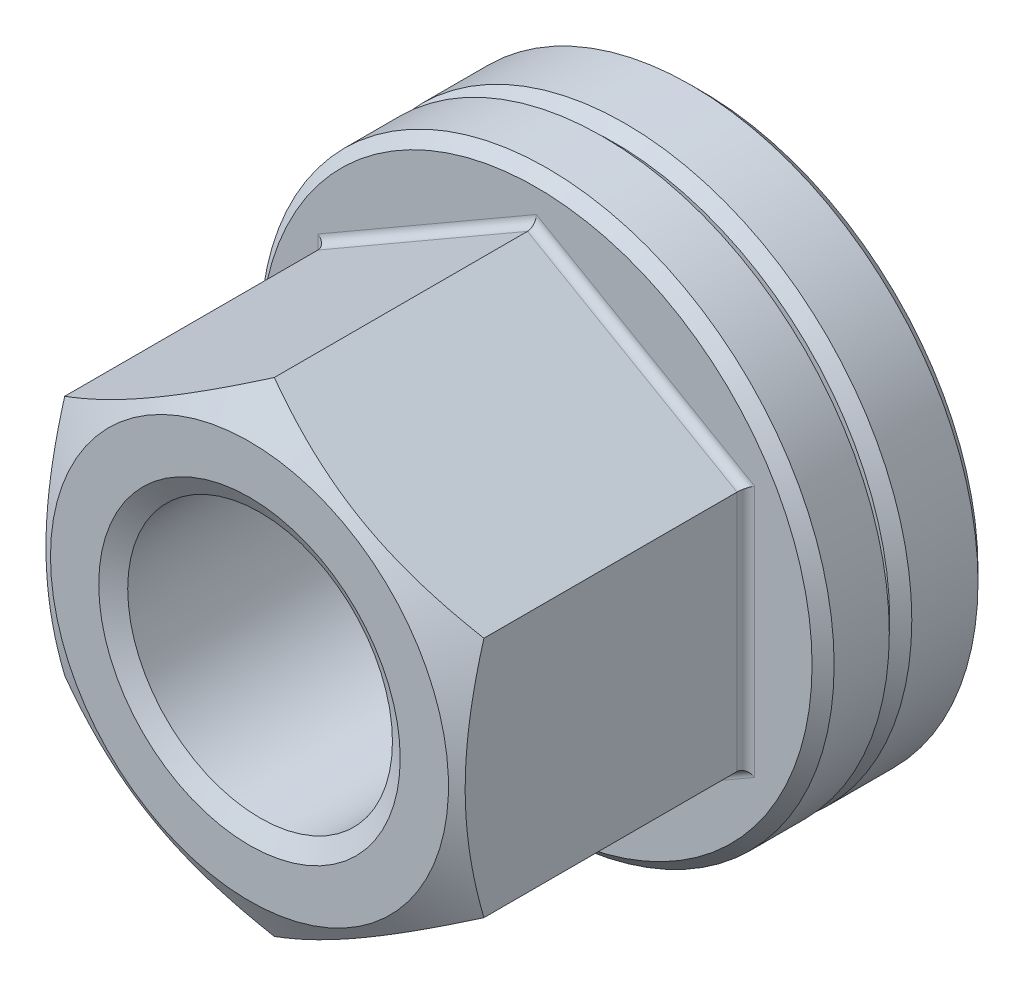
ISO-10303-21;
HEADER;
FILE_DESCRIPTION(('STEP AP214'),'2;1');
FILE_NAME('part.step','',(''),(''),'','','');
FILE_SCHEMA(('AUTOMOTIVE_DESIGN { 1 0 10303 214 1 1 1 1 }'));
ENDSEC;
DATA;
#1=APPLICATION_CONTEXT('core data for automotive mechanical design processes');
#2=APPLICATION_PROTOCOL_DEFINITION('international standard','automotive_design',2000,#1);
#3=PRODUCT_CONTEXT('',#1,'mechanical');
#4=PRODUCT('Part','Part','',(#3));
#5=PRODUCT_RELATED_PRODUCT_CATEGORY('part','',(#4));
#6=PRODUCT_DEFINITION_FORMATION('','',#4);
#7=PRODUCT_DEFINITION_CONTEXT('part definition',#1,'design');
#8=PRODUCT_DEFINITION('design','',#6,#7);
#9=PRODUCT_DEFINITION_SHAPE('','',#8);
#10=(LENGTH_UNIT() NAMED_UNIT(*) SI_UNIT(.MILLI.,.METRE.));
#11=(NAMED_UNIT(*) PLANE_ANGLE_UNIT() SI_UNIT($,.RADIAN.));
#12=(NAMED_UNIT(*) SI_UNIT($,.STERADIAN.) SOLID_ANGLE_UNIT());
#13=UNCERTAINTY_MEASURE_WITH_UNIT(LENGTH_MEASURE(1.E-05),#10,'distance_accuracy_value','');
#14=(GEOMETRIC_REPRESENTATION_CONTEXT(3) GLOBAL_UNCERTAINTY_ASSIGNED_CONTEXT((#13)) GLOBAL_UNIT_ASSIGNED_CONTEXT((#10,
#11,#12)) REPRESENTATION_CONTEXT('',''));
#15=CARTESIAN_POINT('',(0.,0.,0.));
#16=DIRECTION('',(0.,0.,1.));
#17=DIRECTION('',(1.,0.,0.));
#18=AXIS2_PLACEMENT_3D('',#15,#16,#17);
#19=CARTESIAN_POINT('',(0.,0.,4.));
#20=DIRECTION('',(0.,0.,1.));
#21=DIRECTION('',(1.,0.,0.));
#22=AXIS2_PLACEMENT_3D('',#19,#20,#21);
#23=PLANE('',#22);
#24=CARTESIAN_POINT('',(0.,0.,4.));
#25=DIRECTION('',(0.,0.,1.));
#26=DIRECTION('',(1.,0.,0.));
#27=AXIS2_PLACEMENT_3D('',#24,#25,#26);
#28=CIRCLE('',#27,12.5);
#29=CARTESIAN_POINT('',(12.5,0.,4.));
#30=VERTEX_POINT('',#29);
#31=EDGE_CURVE('E381',#30,#30,#28,.T.);
#32=ORIENTED_EDGE('',*,*,#31,.T.);
#33=EDGE_LOOP('',(#32));
#34=FACE_BOUND('',#33,.T.);
#35=CARTESIAN_POINT('',(0.,0.,4.));
#36=DIRECTION('',(0.,0.,1.));
#37=DIRECTION('',(1.,0.,0.));
#38=AXIS2_PLACEMENT_3D('',#35,#36,#37);
#39=CIRCLE('',#38,11.8563781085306);
#40=CARTESIAN_POINT('',(0.,11.8563781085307,4.));
#41=VERTEX_POINT('',#40);
#42=EDGE_CURVE('E9',#41,#41,#39,.F.);
#43=ORIENTED_EDGE('',*,*,#42,.T.);
#44=EDGE_LOOP('',(#43));
#45=FACE_BOUND('',#44,.T.);
#46=ADVANCED_FACE('F14',(#34,#45),#23,.T.);
#47=CARTESIAN_POINT('',(0.,0.,39.3553390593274));
#48=DIRECTION('',(0.,0.,-1.));
#49=DIRECTION('',(-1.,0.,0.));
#50=AXIS2_PLACEMENT_3D('',#47,#48,#49);
#51=CYLINDRICAL_SURFACE('',#50,8.);
#52=CARTESIAN_POINT('',(0.,0.,2.54411906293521));
#53=DIRECTION('',(0.,0.,1.));
#54=DIRECTION('',(1.,0.,0.));
#55=AXIS2_PLACEMENT_3D('',#52,#53,#54);
#56=CIRCLE('',#55,8.);
#57=CARTESIAN_POINT('',(8.,0.,2.54411906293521));
#58=VERTEX_POINT('',#57);
#59=EDGE_CURVE('E153',#58,#58,#56,.T.);
#60=ORIENTED_EDGE('',*,*,#59,.F.);
#61=EDGE_LOOP('',(#60));
#62=FACE_BOUND('',#61,.T.);
#63=CARTESIAN_POINT('',(0.,0.,2.64402577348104));
#64=DIRECTION('',(0.,0.,1.));
#65=DIRECTION('',(1.,0.,0.));
#66=AXIS2_PLACEMENT_3D('',#63,#64,#65);
#67=CIRCLE('',#66,8.);
#68=CARTESIAN_POINT('',(0.,8.00000000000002,2.64402577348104));
#69=VERTEX_POINT('',#68);
#70=EDGE_CURVE('E22',#69,#69,#67,.F.);
#71=ORIENTED_EDGE('',*,*,#70,.F.);
#72=EDGE_LOOP('',(#71));
#73=FACE_BOUND('',#72,.T.);
#74=ADVANCED_FACE('F333',(#62,#73),#51,.F.);
#75=CARTESIAN_POINT('',(0.,0.,2.36213394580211));
#76=DIRECTION('',(0.,0.,1.));
#77=DIRECTION('',(1.,0.,0.));
#78=AXIS2_PLACEMENT_3D('',#75,#76,#77);
#79=CONICAL_SURFACE('',#78,7.5,1.22173047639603);
#80=CARTESIAN_POINT('',(0.,0.,2.36213394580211));
#81=DIRECTION('',(0.,0.,1.));
#82=DIRECTION('',(1.,0.,0.));
#83=AXIS2_PLACEMENT_3D('',#80,#81,#82);
#84=CIRCLE('',#83,7.5);
#85=CARTESIAN_POINT('',(7.5,0.,2.36213394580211));
#86=VERTEX_POINT('',#85);
#87=EDGE_CURVE('E373',#86,#86,#84,.T.);
#88=ORIENTED_EDGE('',*,*,#87,.F.);
#89=EDGE_LOOP('',(#88));
#90=FACE_BOUND('',#89,.T.);
#91=ORIENTED_EDGE('',*,*,#59,.T.);
#92=EDGE_LOOP('',(#91));
#93=FACE_BOUND('',#92,.T.);
#94=ADVANCED_FACE('F339',(#90,#93),#79,.F.);
#95=CARTESIAN_POINT('',(0.,0.,0.));
#96=DIRECTION('',(0.,0.,1.));
#97=DIRECTION('',(1.,0.,0.));
#98=AXIS2_PLACEMENT_3D('',#95,#96,#97);
#99=PLANE('',#98);
#100=CARTESIAN_POINT('',(0.,0.,0.));
#101=DIRECTION('',(0.,0.,1.));
#102=DIRECTION('',(1.,0.,0.));
#103=AXIS2_PLACEMENT_3D('',#100,#101,#102);
#104=CIRCLE('',#103,8.);
#105=CARTESIAN_POINT('',(8.,0.,0.));
#106=VERTEX_POINT('',#105);
#107=EDGE_CURVE('E367',#106,#106,#104,.T.);
#108=ORIENTED_EDGE('',*,*,#107,.T.);
#109=EDGE_LOOP('',(#108));
#110=FACE_BOUND('',#109,.T.);
#111=CARTESIAN_POINT('',(0.,0.,0.));
#112=DIRECTION('',(0.,0.,1.));
#113=DIRECTION('',(1.,0.,0.));
#114=AXIS2_PLACEMENT_3D('',#111,#112,#113);
#115=CIRCLE('',#114,12.5);
#116=CARTESIAN_POINT('',(12.5,0.,0.));
#117=VERTEX_POINT('',#116);
#118=EDGE_CURVE('E368',#117,#117,#115,.F.);
#119=ORIENTED_EDGE('',*,*,#118,.T.);
#120=EDGE_LOOP('',(#119));
#121=FACE_BOUND('',#120,.T.);
#122=ADVANCED_FACE('F347',(#110,#121),#99,.F.);
#123=CARTESIAN_POINT('',(0.,0.,4.));
#124=DIRECTION('',(0.,0.,-1.));
#125=DIRECTION('',(-1.,0.,0.));
#126=AXIS2_PLACEMENT_3D('',#123,#124,#125);
#127=CYLINDRICAL_SURFACE('',#126,13.);
#128=CARTESIAN_POINT('',(0.,0.,0.5));
#129=DIRECTION('',(0.,0.,1.));
#130=DIRECTION('',(1.,0.,0.));
#131=AXIS2_PLACEMENT_3D('',#128,#129,#130);
#132=CIRCLE('',#131,13.);
#133=CARTESIAN_POINT('',(13.,0.,0.5));
#134=VERTEX_POINT('',#133);
#135=EDGE_CURVE('E379',#134,#134,#132,.T.);
#136=ORIENTED_EDGE('',*,*,#135,.T.);
#137=EDGE_LOOP('',(#136));
#138=FACE_BOUND('',#137,.T.);
#139=CARTESIAN_POINT('',(0.,0.,3.5));
#140=DIRECTION('',(0.,0.,1.));
#141=DIRECTION('',(1.,0.,0.));
#142=AXIS2_PLACEMENT_3D('',#139,#140,#141);
#143=CIRCLE('',#142,13.);
#144=CARTESIAN_POINT('',(13.,0.,3.5));
#145=VERTEX_POINT('',#144);
#146=EDGE_CURVE('E370',#145,#145,#143,.F.);
#147=ORIENTED_EDGE('',*,*,#146,.T.);
#148=EDGE_LOOP('',(#147));
#149=FACE_BOUND('',#148,.T.);
#150=ADVANCED_FACE('F350',(#138,#149),#127,.T.);
#151=CARTESIAN_POINT('',(0.,0.,5.33376080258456));
#152=DIRECTION('',(0.,0.,1.));
#153=DIRECTION('',(1.,0.,0.));
#154=AXIS2_PLACEMENT_3D('',#151,#152,#153);
#155=CYLINDRICAL_SURFACE('',#154,7.5);
#156=CARTESIAN_POINT('',(0.,0.,0.5));
#157=DIRECTION('',(0.,0.,1.));
#158=DIRECTION('',(1.,0.,0.));
#159=AXIS2_PLACEMENT_3D('',#156,#157,#158);
#160=CIRCLE('',#159,7.5);
#161=CARTESIAN_POINT('',(7.5,0.,0.5));
#162=VERTEX_POINT('',#161);
#163=EDGE_CURVE('E364',#162,#162,#160,.F.);
#164=ORIENTED_EDGE('',*,*,#163,.T.);
#165=EDGE_LOOP('',(#164));
#166=FACE_BOUND('',#165,.T.);
#167=ORIENTED_EDGE('',*,*,#87,.T.);
#168=EDGE_LOOP('',(#167));
#169=FACE_BOUND('',#168,.T.);
#170=ADVANCED_FACE('F353',(#166,#169),#155,.F.);
#171=CARTESIAN_POINT('',(0.,0.,0.));
#172=DIRECTION('',(0.,0.,-1.));
#173=DIRECTION('',(-1.,0.,0.));
#174=AXIS2_PLACEMENT_3D('',#171,#172,#173);
#175=CONICAL_SURFACE('',#174,8.,0.785398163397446);
#176=ORIENTED_EDGE('',*,*,#163,.F.);
#177=EDGE_LOOP('',(#176));
#178=FACE_BOUND('',#177,.T.);
#179=ORIENTED_EDGE('',*,*,#107,.F.);
#180=EDGE_LOOP('',(#179));
#181=FACE_BOUND('',#180,.T.);
#182=ADVANCED_FACE('F316',(#178,#181),#175,.F.);
#183=CARTESIAN_POINT('',(0.,0.,0.5));
#184=DIRECTION('',(0.,0.,1.));
#185=DIRECTION('',(1.,0.,0.));
#186=AXIS2_PLACEMENT_3D('',#183,#184,#185);
#187=CONICAL_SURFACE('',#186,13.,0.785398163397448);
#188=ORIENTED_EDGE('',*,*,#118,.F.);
#189=EDGE_LOOP('',(#188));
#190=FACE_BOUND('',#189,.T.);
#191=ORIENTED_EDGE('',*,*,#135,.F.);
#192=EDGE_LOOP('',(#191));
#193=FACE_BOUND('',#192,.T.);
#194=ADVANCED_FACE('F308',(#190,#193),#187,.T.);
#195=CARTESIAN_POINT('',(0.,0.,4.));
#196=DIRECTION('',(0.,0.,-1.));
#197=DIRECTION('',(-1.,0.,0.));
#198=AXIS2_PLACEMENT_3D('',#195,#196,#197);
#199=CONICAL_SURFACE('',#198,12.5,0.785398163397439);
#200=ORIENTED_EDGE('',*,*,#146,.F.);
#201=EDGE_LOOP('',(#200));
#202=FACE_BOUND('',#201,.T.);
#203=ORIENTED_EDGE('',*,*,#31,.F.);
#204=EDGE_LOOP('',(#203));
#205=FACE_BOUND('',#204,.T.);
#206=ADVANCED_FACE('F301',(#202,#205),#199,.T.);
#207=CARTESIAN_POINT('',(0.,0.,20.5206786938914));
#208=DIRECTION('',(0.,0.,-1.));
#209=DIRECTION('',(-1.,0.,0.));
#210=AXIS2_PLACEMENT_3D('',#207,#208,#209);
#211=CONICAL_SURFACE('',#210,9.01965511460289,1.0471975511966);
#212=CARTESIAN_POINT('',(0.,0.,20.5206786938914));
#213=DIRECTION('',(0.,0.,-1.));
#214=DIRECTION('',(-1.,0.,0.));
#215=AXIS2_PLACEMENT_3D('',#212,#213,#214);
#216=CIRCLE('',#215,9.01965511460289);
#217=CARTESIAN_POINT('',(-9.01965511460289,0.,20.5206786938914));
#218=VERTEX_POINT('',#217);
#219=EDGE_CURVE('E187',#218,#218,#216,.T.);
#220=ORIENTED_EDGE('',*,*,#219,.T.);
#221=EDGE_LOOP('',(#220));
#222=FACE_BOUND('',#221,.T.);
#223=CARTESIAN_POINT('',(-9.5002,5.48471208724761,19.3947790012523));
#224=CARTESIAN_POINT('',(-9.2913692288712,5.6052805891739,19.4643780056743));
#225=CARTESIAN_POINT('',(-9.0817598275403,5.72629863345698,19.5308181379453));
#226=CARTESIAN_POINT('',(-8.66086011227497,5.96930519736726,19.6565041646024));
#227=CARTESIAN_POINT('',(-8.44956926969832,6.09129402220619,19.7157476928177));
#228=CARTESIAN_POINT('',(-7.81229220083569,6.4592261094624,19.8815368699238));
#229=CARTESIAN_POINT('',(-7.38379023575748,6.70662183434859,19.9758370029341));
#230=CARTESIAN_POINT('',(-6.74255666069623,7.07683821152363,20.0864127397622));
#231=CARTESIAN_POINT('',(-6.53174078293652,7.19855281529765,20.1179116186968));
#232=CARTESIAN_POINT('',(-6.10913296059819,7.44254555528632,20.1707332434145));
#233=CARTESIAN_POINT('',(-5.89734099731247,7.56482370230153,20.1920557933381));
#234=CARTESIAN_POINT('',(-5.47340378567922,7.80958396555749,20.2239784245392));
#235=CARTESIAN_POINT('',(-5.26125925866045,7.93206566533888,20.2345912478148));
#236=CARTESIAN_POINT('',(-4.83677424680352,8.17714220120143,20.2448689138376));
#237=CARTESIAN_POINT('',(-4.62443376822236,8.29973703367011,20.2445340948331));
#238=CARTESIAN_POINT('',(-4.22745800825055,8.5289310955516,20.2336780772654));
#239=CARTESIAN_POINT('',(-4.04279470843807,8.63554650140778,20.2244811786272));
#240=CARTESIAN_POINT('',(-3.67389999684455,8.84852796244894,20.1979860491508));
#241=CARTESIAN_POINT('',(-3.48966861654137,8.95489399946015,20.1806872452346));
#242=CARTESIAN_POINT('',(-2.93768832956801,9.27357996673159,20.1170469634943));
#243=CARTESIAN_POINT('',(-2.57091646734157,9.4853358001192,20.0589695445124));
#244=CARTESIAN_POINT('',(-1.8334821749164,9.91109368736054,19.9137754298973));
#245=CARTESIAN_POINT('',(-1.46291385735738,10.1250414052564,19.8260432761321));
#246=CARTESIAN_POINT('',(-0.727303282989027,10.5497463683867,19.6269277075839));
#247=CARTESIAN_POINT('',(-0.362251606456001,10.7605090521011,19.5155910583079));
#248=CARTESIAN_POINT('',(0.000200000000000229,10.9697705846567,19.3947790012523));
#249=B_SPLINE_CURVE_WITH_KNOTS('',3,(#223,#224,#225,#226,#227,#228,#229,#230,#231,#232,#233,
#234,#235,#236,#237,#238,#239,#240,#241,#242,#243,#244,#245,#246,#247,#248),.UNSPECIFIED.,.F.,
.F.,(4,2,2,2,2,2,2,2,2,2,2,2,4),(0.,0.752880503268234,1.50600787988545,3.0154687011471,
3.75167336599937,4.48789219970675,5.22323407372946,5.95855322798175,6.5986808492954,
7.23885375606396,8.52010929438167,9.82978009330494,11.1368800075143),.UNSPECIFIED.);
#250=CARTESIAN_POINT('',(-9.5,5.48482755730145,19.3948456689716));
#251=VERTEX_POINT('',#250);
#252=CARTESIAN_POINT('',(0.,10.9696551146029,19.3948456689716));
#253=VERTEX_POINT('',#252);
#254=EDGE_CURVE('E87',#251,#253,#249,.T.);
#255=ORIENTED_EDGE('',*,*,#254,.F.);
#256=CARTESIAN_POINT('',(-9.5,-14.5081405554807,15.7159174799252));
#257=CARTESIAN_POINT('',(-9.5,-14.2997453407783,15.8165728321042));
#258=CARTESIAN_POINT('',(-9.5,-14.0910971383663,15.9167041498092));
#259=CARTESIAN_POINT('',(-9.5,-13.6732413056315,16.1157983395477));
#260=CARTESIAN_POINT('',(-9.5,-13.4640336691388,16.2147611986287));
#261=CARTESIAN_POINT('',(-9.5,-12.835429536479,16.5097454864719));
#262=CARTESIAN_POINT('',(-9.5,-12.4151202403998,16.7038294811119));
#263=CARTESIAN_POINT('',(-9.5,-11.5691591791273,17.0866890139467));
#264=CARTESIAN_POINT('',(-9.5,-11.1434905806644,17.2754274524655));
#265=CARTESIAN_POINT('',(-9.5,-10.2886412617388,17.6447452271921));
#266=CARTESIAN_POINT('',(-9.5,-9.8594607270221,17.8253249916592));
#267=CARTESIAN_POINT('',(-9.5,-8.9917551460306,18.1782196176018));
#268=CARTESIAN_POINT('',(-9.5,-8.55317963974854,18.3504110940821));
#269=CARTESIAN_POINT('',(-9.5,-7.67084319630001,18.6812121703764));
#270=CARTESIAN_POINT('',(-9.5,-7.2270816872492,18.8398202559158));
#271=CARTESIAN_POINT('',(-9.5,-6.33458604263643,19.1391637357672));
#272=CARTESIAN_POINT('',(-9.5,-5.885864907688,19.2799374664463));
#273=CARTESIAN_POINT('',(-9.5,-4.98206148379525,19.5390180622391));
#274=CARTESIAN_POINT('',(-9.5,-4.5269812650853,19.6573320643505));
#275=CARTESIAN_POINT('',(-9.5,-3.61005735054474,19.8657196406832));
#276=CARTESIAN_POINT('',(-9.5,-3.14821142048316,19.9557836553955));
#277=CARTESIAN_POINT('',(-9.5,-2.45141173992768,20.0651605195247));
#278=CARTESIAN_POINT('',(-9.5,-2.21844485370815,20.0973352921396));
#279=CARTESIAN_POINT('',(-9.5,-1.75143138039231,20.1524782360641));
#280=CARTESIAN_POINT('',(-9.5,-1.51738489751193,20.1754472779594));
#281=CARTESIAN_POINT('',(-9.5,-1.04999217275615,20.2115623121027));
#282=CARTESIAN_POINT('',(-9.5,-0.816650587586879,20.2247683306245));
#283=CARTESIAN_POINT('',(-9.5,-0.349618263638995,20.2412881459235));
#284=CARTESIAN_POINT('',(-9.5,-0.115927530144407,20.2446020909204));
#285=CARTESIAN_POINT('',(-9.5,0.351318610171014,20.2412589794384));
#286=CARTESIAN_POINT('',(-9.5,0.584874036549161,20.2346046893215));
#287=CARTESIAN_POINT('',(-9.5,1.0515023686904,20.211489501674));
#288=CARTESIAN_POINT('',(-9.5,1.2845752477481,20.1950280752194));
#289=CARTESIAN_POINT('',(-9.5,1.85053935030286,20.1434894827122));
#290=CARTESIAN_POINT('',(-9.5,2.18298644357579,20.1034394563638));
#291=CARTESIAN_POINT('',(-9.5,2.84525035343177,20.0056256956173));
#292=CARTESIAN_POINT('',(-9.5,3.17506676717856,19.9478592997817));
#293=CARTESIAN_POINT('',(-9.5,4.16115816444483,19.7508857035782));
#294=CARTESIAN_POINT('',(-9.5,4.81278369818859,19.5881366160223));
#295=CARTESIAN_POINT('',(-9.5,5.78743116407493,19.3078332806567));
#296=CARTESIAN_POINT('',(-9.5,6.11555354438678,19.2070102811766));
#297=CARTESIAN_POINT('',(-9.5,6.76862851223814,18.9953904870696));
#298=CARTESIAN_POINT('',(-9.5,7.09358081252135,18.8845927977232));
#299=CARTESIAN_POINT('',(-9.5,7.73869298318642,18.6553918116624));
#300=CARTESIAN_POINT('',(-9.5,8.05886956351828,18.5370350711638));
#301=CARTESIAN_POINT('',(-9.5,8.69650333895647,18.2935178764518));
#302=CARTESIAN_POINT('',(-9.5,9.01396143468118,18.1683597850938));
#303=CARTESIAN_POINT('',(-9.5,9.33027579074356,18.0404388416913));
#304=B_SPLINE_CURVE_WITH_KNOTS('',3,(#256,#257,#258,#259,#260,#261,#262,#263,#264,#265,#266,
#267,#268,#269,#270,#271,#272,#273,#274,#275,#276,#277,#278,#279,#280,#281,#282,#283,#284,#285,
#286,#287,#288,#289,#290,#291,#292,#293,#294,#295,#296,#297,#298,#299,#300,#301,#302,#303),
.UNSPECIFIED.,.F.,.F.,(4,2,2,2,2,2,2,2,2,2,2,2,2,2,2,2,2,2,2,2,2,2,2,4),(0.,0.694290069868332,
1.38858782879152,2.77741141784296,4.17425003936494,5.57101525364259,6.98434198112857,
8.39782606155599,9.80821824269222,11.2181614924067,12.6285813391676,13.333962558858,
14.0392770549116,14.7402181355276,15.4411487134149,16.1418848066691,16.8426586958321,
17.8466399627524,18.8507721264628,20.8629143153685,21.8926247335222,22.9224276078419,
23.9464065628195,24.9700320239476),.UNSPECIFIED.);
#305=CARTESIAN_POINT('',(-9.5,-5.48482755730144,19.3948456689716));
#306=VERTEX_POINT('',#305);
#307=EDGE_CURVE('E90',#306,#251,#304,.T.);
#308=ORIENTED_EDGE('',*,*,#307,.F.);
#309=CARTESIAN_POINT('',(0.00019999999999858,-10.9697705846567,19.3947790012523));
#310=CARTESIAN_POINT('',(-0.208630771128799,-10.8492020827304,19.4643780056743));
#311=CARTESIAN_POINT('',(-0.418240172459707,-10.7281840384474,19.5308181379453));
#312=CARTESIAN_POINT('',(-0.839139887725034,-10.4851774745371,19.6565041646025));
#313=CARTESIAN_POINT('',(-1.05043073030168,-10.3631886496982,19.7157476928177));
#314=CARTESIAN_POINT('',(-1.68770779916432,-9.99525656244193,19.8815368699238));
#315=CARTESIAN_POINT('',(-2.11620976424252,-9.74786083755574,19.9758370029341));
#316=CARTESIAN_POINT('',(-2.75744333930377,-9.37764446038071,20.0864127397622));
#317=CARTESIAN_POINT('',(-2.96825921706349,-9.25592985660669,20.1179116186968));
#318=CARTESIAN_POINT('',(-3.39086703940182,-9.01193711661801,20.1707332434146));
#319=CARTESIAN_POINT('',(-3.60265900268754,-8.8896589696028,20.1920557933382));
#320=CARTESIAN_POINT('',(-4.02659621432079,-8.64489870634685,20.2239784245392));
#321=CARTESIAN_POINT('',(-4.23874074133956,-8.52241700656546,20.2345912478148));
#322=CARTESIAN_POINT('',(-4.66322575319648,-8.2773404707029,20.2448689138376));
#323=CARTESIAN_POINT('',(-4.87556623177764,-8.15474563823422,20.2445340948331));
#324=CARTESIAN_POINT('',(-5.27254199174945,-7.92555157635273,20.2336780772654));
#325=CARTESIAN_POINT('',(-5.45720529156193,-7.81893617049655,20.2244811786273));
#326=CARTESIAN_POINT('',(-5.82610000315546,-7.6059547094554,20.1979860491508));
#327=CARTESIAN_POINT('',(-6.01033138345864,-7.49958867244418,20.1806872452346));
#328=CARTESIAN_POINT('',(-6.562311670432,-7.18090270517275,20.1170469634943));
#329=CARTESIAN_POINT('',(-6.92908353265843,-6.96914687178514,20.0589695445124));
#330=CARTESIAN_POINT('',(-7.66651782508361,-6.5433889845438,19.9137754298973));
#331=CARTESIAN_POINT('',(-8.03708614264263,-6.32944126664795,19.8260432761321));
#332=CARTESIAN_POINT('',(-8.77269671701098,-5.90473630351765,19.626927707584));
#333=CARTESIAN_POINT('',(-9.137748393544,-5.69397361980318,19.5155910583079));
#334=CARTESIAN_POINT('',(-9.5002,-5.4847120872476,19.3947790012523));
#335=B_SPLINE_CURVE_WITH_KNOTS('',3,(#309,#310,#311,#312,#313,#314,#315,#316,#317,#318,#319,
#320,#321,#322,#323,#324,#325,#326,#327,#328,#329,#330,#331,#332,#333,#334),.UNSPECIFIED.,.F.,
.F.,(4,2,2,2,2,2,2,2,2,2,2,2,4),(0.,0.752880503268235,1.50600787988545,3.0154687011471,
3.75167336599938,4.48789219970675,5.22323407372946,5.95855322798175,6.5986808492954,
7.23885375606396,8.52010929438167,9.82978009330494,11.1368800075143),.UNSPECIFIED.);
#336=CARTESIAN_POINT('',(0.,-10.9696551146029,19.3948456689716));
#337=VERTEX_POINT('',#336);
#338=EDGE_CURVE('E106',#337,#306,#335,.T.);
#339=ORIENTED_EDGE('',*,*,#338,.F.);
#340=CARTESIAN_POINT('',(9.5002,-5.48471208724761,19.3947790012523));
#341=CARTESIAN_POINT('',(9.2913692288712,-5.6052805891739,19.4643780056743));
#342=CARTESIAN_POINT('',(9.0817598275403,-5.72629863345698,19.5308181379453));
#343=CARTESIAN_POINT('',(8.66086011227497,-5.96930519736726,19.6565041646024));
#344=CARTESIAN_POINT('',(8.44956926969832,-6.09129402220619,19.7157476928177));
#345=CARTESIAN_POINT('',(7.81229220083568,-6.4592261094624,19.8815368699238));
#346=CARTESIAN_POINT('',(7.38379023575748,-6.70662183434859,19.9758370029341));
#347=CARTESIAN_POINT('',(6.74255666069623,-7.07683821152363,20.0864127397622));
#348=CARTESIAN_POINT('',(6.53174078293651,-7.19855281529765,20.1179116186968));
#349=CARTESIAN_POINT('',(6.10913296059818,-7.44254555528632,20.1707332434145));
#350=CARTESIAN_POINT('',(5.89734099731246,-7.56482370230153,20.1920557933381));
#351=CARTESIAN_POINT('',(5.47340378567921,-7.80958396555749,20.2239784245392));
#352=CARTESIAN_POINT('',(5.26125925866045,-7.93206566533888,20.2345912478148));
#353=CARTESIAN_POINT('',(4.83677424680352,-8.17714220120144,20.2448689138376));
#354=CARTESIAN_POINT('',(4.62443376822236,-8.29973703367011,20.2445340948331));
#355=CARTESIAN_POINT('',(4.22745800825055,-8.5289310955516,20.2336780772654));
#356=CARTESIAN_POINT('',(4.04279470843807,-8.63554650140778,20.2244811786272));
#357=CARTESIAN_POINT('',(3.67389999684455,-8.84852796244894,20.1979860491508));
#358=CARTESIAN_POINT('',(3.48966861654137,-8.95489399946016,20.1806872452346));
#359=CARTESIAN_POINT('',(2.937688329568,-9.27357996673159,20.1170469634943));
#360=CARTESIAN_POINT('',(2.57091646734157,-9.4853358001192,20.0589695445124));
#361=CARTESIAN_POINT('',(1.8334821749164,-9.91109368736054,19.9137754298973));
#362=CARTESIAN_POINT('',(1.46291385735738,-10.1250414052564,19.8260432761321));
#363=CARTESIAN_POINT('',(0.727303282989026,-10.5497463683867,19.6269277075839));
#364=CARTESIAN_POINT('',(0.362251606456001,-10.7605090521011,19.5155910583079));
#365=CARTESIAN_POINT('',(-0.000200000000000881,-10.9697705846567,19.3947790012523));
#366=B_SPLINE_CURVE_WITH_KNOTS('',3,(#340,#341,#342,#343,#344,#345,#346,#347,#348,#349,#350,
#351,#352,#353,#354,#355,#356,#357,#358,#359,#360,#361,#362,#363,#364,#365),.UNSPECIFIED.,.F.,
.F.,(4,2,2,2,2,2,2,2,2,2,2,2,4),(0.,0.752880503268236,1.50600787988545,3.0154687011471,
3.75167336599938,4.48789219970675,5.22323407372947,5.95855322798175,6.5986808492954,
7.23885375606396,8.52010929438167,9.82978009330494,11.1368800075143),.UNSPECIFIED.);
#367=CARTESIAN_POINT('',(9.5,-5.48482755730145,19.3948456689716));
#368=VERTEX_POINT('',#367);
#369=EDGE_CURVE('E199',#368,#337,#366,.T.);
#370=ORIENTED_EDGE('',*,*,#369,.F.);
#371=CARTESIAN_POINT('',(9.5,-14.5081405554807,15.7159174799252));
#372=CARTESIAN_POINT('',(9.5,-14.2997453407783,15.8165728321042));
#373=CARTESIAN_POINT('',(9.5,-14.0910971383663,15.9167041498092));
#374=CARTESIAN_POINT('',(9.5,-13.6732413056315,16.1157983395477));
#375=CARTESIAN_POINT('',(9.5,-13.4640336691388,16.2147611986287));
#376=CARTESIAN_POINT('',(9.5,-12.835429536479,16.5097454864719));
#377=CARTESIAN_POINT('',(9.5,-12.4151202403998,16.7038294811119));
#378=CARTESIAN_POINT('',(9.5,-11.5691591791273,17.0866890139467));
#379=CARTESIAN_POINT('',(9.5,-11.1434905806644,17.2754274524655));
#380=CARTESIAN_POINT('',(9.5,-10.2886412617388,17.6447452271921));
#381=CARTESIAN_POINT('',(9.5,-9.85946072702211,17.8253249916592));
#382=CARTESIAN_POINT('',(9.5,-8.99175514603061,18.1782196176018));
#383=CARTESIAN_POINT('',(9.5,-8.55317963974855,18.3504110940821));
#384=CARTESIAN_POINT('',(9.5,-7.67084319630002,18.6812121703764));
#385=CARTESIAN_POINT('',(9.5,-7.2270816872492,18.8398202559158));
#386=CARTESIAN_POINT('',(9.5,-6.33458604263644,19.1391637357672));
#387=CARTESIAN_POINT('',(9.5,-5.885864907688,19.2799374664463));
#388=CARTESIAN_POINT('',(9.5,-4.98206148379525,19.5390180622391));
#389=CARTESIAN_POINT('',(9.5,-4.52698126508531,19.6573320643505));
#390=CARTESIAN_POINT('',(9.5,-3.61005735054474,19.8657196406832));
#391=CARTESIAN_POINT('',(9.5,-3.14821142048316,19.9557836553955));
#392=CARTESIAN_POINT('',(9.5,-2.45141173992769,20.0651605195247));
#393=CARTESIAN_POINT('',(9.5,-2.21844485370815,20.0973352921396));
#394=CARTESIAN_POINT('',(9.5,-1.75143138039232,20.1524782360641));
#395=CARTESIAN_POINT('',(9.5,-1.51738489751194,20.1754472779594));
#396=CARTESIAN_POINT('',(9.5,-1.04999217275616,20.2115623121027));
#397=CARTESIAN_POINT('',(9.5,-0.816650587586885,20.2247683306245));
#398=CARTESIAN_POINT('',(9.5,-0.349618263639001,20.2412881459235));
#399=CARTESIAN_POINT('',(9.5,-0.115927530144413,20.2446020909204));
#400=CARTESIAN_POINT('',(9.5,0.351318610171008,20.2412589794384));
#401=CARTESIAN_POINT('',(9.5,0.584874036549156,20.2346046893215));
#402=CARTESIAN_POINT('',(9.5,1.0515023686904,20.211489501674));
#403=CARTESIAN_POINT('',(9.5,1.2845752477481,20.1950280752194));
#404=CARTESIAN_POINT('',(9.5,1.85053935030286,20.1434894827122));
#405=CARTESIAN_POINT('',(9.5,2.18298644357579,20.1034394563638));
#406=CARTESIAN_POINT('',(9.5,2.84525035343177,20.0056256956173));
#407=CARTESIAN_POINT('',(9.5,3.17506676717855,19.9478592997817));
#408=CARTESIAN_POINT('',(9.5,4.16115816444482,19.7508857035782));
#409=CARTESIAN_POINT('',(9.5,4.81278369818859,19.5881366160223));
#410=CARTESIAN_POINT('',(9.5,5.78743116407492,19.3078332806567));
#411=CARTESIAN_POINT('',(9.5,6.11555354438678,19.2070102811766));
#412=CARTESIAN_POINT('',(9.5,6.76862851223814,18.9953904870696));
#413=CARTESIAN_POINT('',(9.5,7.09358081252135,18.8845927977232));
#414=CARTESIAN_POINT('',(9.5,7.73869298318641,18.6553918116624));
#415=CARTESIAN_POINT('',(9.5,8.05886956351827,18.5370350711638));
#416=CARTESIAN_POINT('',(9.5,8.69650333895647,18.2935178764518));
#417=CARTESIAN_POINT('',(9.5,9.01396143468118,18.1683597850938));
#418=CARTESIAN_POINT('',(9.5,9.33027579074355,18.0404388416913));
#419=B_SPLINE_CURVE_WITH_KNOTS('',3,(#371,#372,#373,#374,#375,#376,#377,#378,#379,#380,#381,
#382,#383,#384,#385,#386,#387,#388,#389,#390,#391,#392,#393,#394,#395,#396,#397,#398,#399,#400,
#401,#402,#403,#404,#405,#406,#407,#408,#409,#410,#411,#412,#413,#414,#415,#416,#417,#418),
.UNSPECIFIED.,.F.,.F.,(4,2,2,2,2,2,2,2,2,2,2,2,2,2,2,2,2,2,2,2,2,2,2,4),(0.,0.694290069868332,
1.38858782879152,2.77741141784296,4.17425003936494,5.57101525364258,6.98434198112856,
8.39782606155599,9.80821824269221,11.2181614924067,12.6285813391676,13.333962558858,
14.0392770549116,14.7402181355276,15.4411487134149,16.1418848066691,16.8426586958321,
17.8466399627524,18.8507721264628,20.8629143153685,21.8926247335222,22.9224276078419,
23.9464065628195,24.9700320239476),.UNSPECIFIED.);
#420=CARTESIAN_POINT('',(9.5,5.48482755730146,19.3948456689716));
#421=VERTEX_POINT('',#420);
#422=EDGE_CURVE('E190',#421,#368,#419,.F.);
#423=ORIENTED_EDGE('',*,*,#422,.F.);
#424=CARTESIAN_POINT('',(-0.000199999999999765,10.9697705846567,19.3947790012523));
#425=CARTESIAN_POINT('',(0.208630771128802,10.8492020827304,19.4643780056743));
#426=CARTESIAN_POINT('',(0.418240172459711,10.7281840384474,19.5308181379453));
#427=CARTESIAN_POINT('',(0.839139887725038,10.4851774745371,19.6565041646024));
#428=CARTESIAN_POINT('',(1.05043073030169,10.3631886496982,19.7157476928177));
#429=CARTESIAN_POINT('',(1.68770779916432,9.99525656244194,19.8815368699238));
#430=CARTESIAN_POINT('',(2.11620976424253,9.74786083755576,19.9758370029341));
#431=CARTESIAN_POINT('',(2.75744333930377,9.37764446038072,20.0864127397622));
#432=CARTESIAN_POINT('',(2.96825921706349,9.2559298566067,20.1179116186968));
#433=CARTESIAN_POINT('',(3.39086703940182,9.01193711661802,20.1707332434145));
#434=CARTESIAN_POINT('',(3.60265900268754,8.88965896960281,20.1920557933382));
#435=CARTESIAN_POINT('',(4.02659621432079,8.64489870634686,20.2239784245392));
#436=CARTESIAN_POINT('',(4.23874074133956,8.52241700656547,20.2345912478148));
#437=CARTESIAN_POINT('',(4.66322575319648,8.27734047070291,20.2448689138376));
#438=CARTESIAN_POINT('',(4.87556623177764,8.15474563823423,20.2445340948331));
#439=CARTESIAN_POINT('',(5.27254199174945,7.92555157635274,20.2336780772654));
#440=CARTESIAN_POINT('',(5.45720529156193,7.81893617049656,20.2244811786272));
#441=CARTESIAN_POINT('',(5.82610000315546,7.60595470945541,20.1979860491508));
#442=CARTESIAN_POINT('',(6.01033138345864,7.49958867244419,20.1806872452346));
#443=CARTESIAN_POINT('',(6.562311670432,7.18090270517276,20.1170469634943));
#444=CARTESIAN_POINT('',(6.92908353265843,6.96914687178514,20.0589695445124));
#445=CARTESIAN_POINT('',(7.66651782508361,6.54338898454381,19.9137754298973));
#446=CARTESIAN_POINT('',(8.03708614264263,6.32944126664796,19.8260432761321));
#447=CARTESIAN_POINT('',(8.77269671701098,5.90473630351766,19.6269277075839));
#448=CARTESIAN_POINT('',(9.137748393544,5.69397361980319,19.5155910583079));
#449=CARTESIAN_POINT('',(9.5002,5.48471208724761,19.3947790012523));
#450=B_SPLINE_CURVE_WITH_KNOTS('',3,(#424,#425,#426,#427,#428,#429,#430,#431,#432,#433,#434,
#435,#436,#437,#438,#439,#440,#441,#442,#443,#444,#445,#446,#447,#448,#449),.UNSPECIFIED.,.F.,
.F.,(4,2,2,2,2,2,2,2,2,2,2,2,4),(0.,0.752880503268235,1.50600787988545,3.0154687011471,
3.75167336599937,4.48789219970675,5.22323407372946,5.95855322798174,6.5986808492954,
7.23885375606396,8.52010929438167,9.82978009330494,11.1368800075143),.UNSPECIFIED.);
#451=EDGE_CURVE('E93',#253,#421,#450,.T.);
#452=ORIENTED_EDGE('',*,*,#451,.F.);
#453=EDGE_LOOP('',(#255,#308,#339,#370,#423,#452));
#454=FACE_BOUND('',#453,.T.);
#455=ADVANCED_FACE('F89',(#222,#454),#211,.T.);
#456=CARTESIAN_POINT('',(0.,10.9696551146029,20.5206786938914));
#457=DIRECTION('',(0.,0.,1.));
#458=DIRECTION('',(1.,0.,0.));
#459=AXIS2_PLACEMENT_3D('',#456,#457,#458);
#460=PLANE('',#459);
#461=CARTESIAN_POINT('',(0.,0.,20.5206786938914));
#462=DIRECTION('',(0.,0.,1.));
#463=DIRECTION('',(1.,0.,0.));
#464=AXIS2_PLACEMENT_3D('',#461,#462,#463);
#465=CIRCLE('',#464,6.83205080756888);
#466=CARTESIAN_POINT('',(6.83205080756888,0.,20.5206786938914));
#467=VERTEX_POINT('',#466);
#468=EDGE_CURVE('E128',#467,#467,#465,.F.);
#469=ORIENTED_EDGE('',*,*,#468,.T.);
#470=EDGE_LOOP('',(#469));
#471=FACE_BOUND('',#470,.T.);
#472=ORIENTED_EDGE('',*,*,#219,.F.);
#473=EDGE_LOOP('',(#472));
#474=FACE_BOUND('',#473,.T.);
#475=ADVANCED_FACE('F214',(#471,#474),#460,.T.);
#476=CARTESIAN_POINT('',(0.,0.,19.5206786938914));
#477=DIRECTION('',(0.,0.,1.));
#478=DIRECTION('',(1.,0.,0.));
#479=AXIS2_PLACEMENT_3D('',#476,#477,#478);
#480=CONICAL_SURFACE('',#479,5.1,1.0471975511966);
#481=CARTESIAN_POINT('',(0.,0.,20.0402939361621));
#482=DIRECTION('',(0.,0.,1.));
#483=DIRECTION('',(1.,0.,0.));
#484=AXIS2_PLACEMENT_3D('',#481,#482,#483);
#485=CIRCLE('',#484,6.);
#486=CARTESIAN_POINT('',(6.,0.,20.0402939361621));
#487=VERTEX_POINT('',#486);
#488=EDGE_CURVE('E171',#487,#487,#485,.T.);
#489=ORIENTED_EDGE('',*,*,#488,.F.);
#490=EDGE_LOOP('',(#489));
#491=FACE_BOUND('',#490,.T.);
#492=ORIENTED_EDGE('',*,*,#468,.F.);
#493=EDGE_LOOP('',(#492));
#494=FACE_BOUND('',#493,.T.);
#495=ADVANCED_FACE('F274',(#491,#494),#480,.F.);
#496=CARTESIAN_POINT('',(0.,0.,2.52067869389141));
#497=DIRECTION('',(0.,0.,1.));
#498=DIRECTION('',(1.,0.,0.));
#499=AXIS2_PLACEMENT_3D('',#496,#497,#498);
#500=CYLINDRICAL_SURFACE('',#499,6.);
#501=CARTESIAN_POINT('',(0.,0.,3.00106345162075));
#502=DIRECTION('',(0.,0.,-1.));
#503=DIRECTION('',(-1.,0.,0.));
#504=AXIS2_PLACEMENT_3D('',#501,#502,#503);
#505=CIRCLE('',#504,6.);
#506=CARTESIAN_POINT('',(-6.,0.,3.00106345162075));
#507=VERTEX_POINT('',#506);
#508=EDGE_CURVE('E157',#507,#507,#505,.T.);
#509=ORIENTED_EDGE('',*,*,#508,.T.);
#510=EDGE_LOOP('',(#509));
#511=FACE_BOUND('',#510,.T.);
#512=ORIENTED_EDGE('',*,*,#488,.T.);
#513=EDGE_LOOP('',(#512));
#514=FACE_BOUND('',#513,.T.);
#515=ADVANCED_FACE('F272',(#511,#514),#500,.F.);
#516=CARTESIAN_POINT('',(0.,0.,2.52067869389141));
#517=DIRECTION('',(0.,0.,-1.));
#518=DIRECTION('',(-1.,0.,0.));
#519=AXIS2_PLACEMENT_3D('',#516,#517,#518);
#520=CONICAL_SURFACE('',#519,6.83205080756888,1.0471975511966);
#521=ORIENTED_EDGE('',*,*,#508,.F.);
#522=EDGE_LOOP('',(#521));
#523=FACE_BOUND('',#522,.T.);
#524=CARTESIAN_POINT('',(0.,0.,2.52067869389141));
#525=DIRECTION('',(0.,0.,1.));
#526=DIRECTION('',(1.,0.,0.));
#527=AXIS2_PLACEMENT_3D('',#524,#525,#526);
#528=CIRCLE('',#527,6.83205080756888);
#529=CARTESIAN_POINT('',(6.83205080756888,0.,2.52067869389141));
#530=VERTEX_POINT('',#529);
#531=EDGE_CURVE('E125',#530,#530,#528,.T.);
#532=ORIENTED_EDGE('',*,*,#531,.F.);
#533=EDGE_LOOP('',(#532));
#534=FACE_BOUND('',#533,.T.);
#535=ADVANCED_FACE('F260',(#523,#534),#520,.F.);
#536=CARTESIAN_POINT('',(0.,0.,2.52067869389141));
#537=DIRECTION('',(0.,0.,1.));
#538=DIRECTION('',(1.,0.,0.));
#539=AXIS2_PLACEMENT_3D('',#536,#537,#538);
#540=PLANE('',#539);
#541=ORIENTED_EDGE('',*,*,#531,.T.);
#542=EDGE_LOOP('',(#541));
#543=FACE_BOUND('',#542,.T.);
#544=CARTESIAN_POINT('',(0.,0.,2.52067869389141));
#545=DIRECTION('',(0.,0.,-1.));
#546=DIRECTION('',(-1.,0.,0.));
#547=AXIS2_PLACEMENT_3D('',#544,#545,#546);
#548=CIRCLE('',#547,7.54002342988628);
#549=CARTESIAN_POINT('',(0.,7.54002342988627,2.52067869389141));
#550=VERTEX_POINT('',#549);
#551=EDGE_CURVE('E184',#550,#550,#548,.T.);
#552=ORIENTED_EDGE('',*,*,#551,.T.);
#553=EDGE_LOOP('',(#552));
#554=FACE_BOUND('',#553,.T.);
#555=ADVANCED_FACE('F257',(#543,#554),#540,.F.);
#556=CARTESIAN_POINT('',(0.,0.,31.557690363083));
#557=DIRECTION('',(0.,0.,-1.));
#558=DIRECTION('',(0.,1.,0.));
#559=AXIS2_PLACEMENT_3D('',#556,#557,#558);
#560=SPHERICAL_SURFACE('',#559,30.);
#561=CARTESIAN_POINT('',(0.,7.54002342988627,2.52067869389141));
#562=CARTESIAN_POINT('',(0.,7.54482495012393,2.52192550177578));
#563=CARTESIAN_POINT('',(0.,7.54962616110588,2.52317350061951));
#564=CARTESIAN_POINT('',(0.,7.55922796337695,2.52567187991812));
#565=CARTESIAN_POINT('',(0.,7.56402855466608,2.52692226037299));
#566=CARTESIAN_POINT('',(0.,7.57362911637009,2.52942540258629));
#567=CARTESIAN_POINT('',(0.,7.57842908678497,2.53067816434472));
#568=CARTESIAN_POINT('',(0.,7.58802840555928,2.53318606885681));
#569=CARTESIAN_POINT('',(0.,7.5928277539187,2.53444121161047));
#570=CARTESIAN_POINT('',(0.,7.60242582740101,2.53695387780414));
#571=CARTESIAN_POINT('',(0.,7.60722455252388,2.53821140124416));
#572=CARTESIAN_POINT('',(0.,7.61682137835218,2.54072882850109));
#573=CARTESIAN_POINT('',(0.,7.62161947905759,2.54198873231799));
#574=CARTESIAN_POINT('',(0.,7.63121505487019,2.54451092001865));
#575=CARTESIAN_POINT('',(0.,7.63601252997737,2.5457732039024));
#576=CARTESIAN_POINT('',(0.,7.64560685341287,2.5483001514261));
#577=CARTESIAN_POINT('',(0.,7.65040370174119,2.54956481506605));
#578=CARTESIAN_POINT('',(0.,7.65999677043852,2.55209652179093));
#579=CARTESIAN_POINT('',(0.,7.66479299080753,2.55336356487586));
#580=CARTESIAN_POINT('',(0.,7.67438480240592,2.55590003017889));
#581=CARTESIAN_POINT('',(0.,7.6791803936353,2.55716945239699));
#582=CARTESIAN_POINT('',(0.,7.6887709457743,2.55971067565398));
#583=CARTESIAN_POINT('',(0.,7.6935659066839,2.56098247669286));
#584=CARTESIAN_POINT('',(0.,7.70315519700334,2.56352845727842));
#585=CARTESIAN_POINT('',(0.,7.70794952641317,2.5648026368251));
#586=CARTESIAN_POINT('',(0.,7.71753755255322,2.56735337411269));
#587=CARTESIAN_POINT('',(0.,7.72233124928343,2.5686299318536));
#588=CARTESIAN_POINT('',(0.,7.73191800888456,2.57118542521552));
#589=CARTESIAN_POINT('',(0.,7.73671107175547,2.57246436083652));
#590=CARTESIAN_POINT('',(0.,7.74629656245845,2.57502460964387));
#591=CARTESIAN_POINT('',(0.,7.75108899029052,2.57630592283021));
#592=CARTESIAN_POINT('',(0.,7.76067320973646,2.57887092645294));
#593=CARTESIAN_POINT('',(0.,7.76546500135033,2.58015461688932));
#594=CARTESIAN_POINT('',(0.,7.77504794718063,2.58272437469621));
#595=CARTESIAN_POINT('',(0.,7.77983910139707,2.58401044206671));
#596=CARTESIAN_POINT('',(0.,7.78942077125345,2.58658495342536));
#597=CARTESIAN_POINT('',(0.,7.7942112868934,2.5878733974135));
#598=CARTESIAN_POINT('',(0.,7.8037916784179,2.59045266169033));
#599=CARTESIAN_POINT('',(0.,7.80858155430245,2.59174348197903));
#600=CARTESIAN_POINT('',(0.,7.81816066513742,2.59432749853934));
#601=CARTESIAN_POINT('',(0.,7.82294990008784,2.59562069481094));
#602=CARTESIAN_POINT('',(0.,7.83252772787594,2.59820946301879));
#603=CARTESIAN_POINT('',(0.,7.83731632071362,2.59950503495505));
#604=CARTESIAN_POINT('',(0.,7.84689286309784,2.60209855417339));
#605=CARTESIAN_POINT('',(0.,7.85168081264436,2.60339650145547));
#606=CARTESIAN_POINT('',(0.,7.86125606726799,2.60599477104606));
#607=CARTESIAN_POINT('',(0.,7.86604337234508,2.60729509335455));
#608=CARTESIAN_POINT('',(0.,7.87561733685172,2.60989811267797));
#609=CARTESIAN_POINT('',(0.,7.88040399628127,2.61120080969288));
#610=CARTESIAN_POINT('',(0.,7.88997666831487,2.61380857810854));
#611=CARTESIAN_POINT('',(0.,7.89476268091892,2.61511364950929));
#612=CARTESIAN_POINT('',(0.,7.90433405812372,2.61772616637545));
#613=CARTESIAN_POINT('',(0.,7.90911942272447,2.61903361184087));
#614=CARTESIAN_POINT('',(0.,7.91868950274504,2.62165087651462));
#615=CARTESIAN_POINT('',(0.,7.92347421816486,2.62296069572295));
#616=CARTESIAN_POINT('',(0.,7.93304299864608,2.62558270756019));
#617=CARTESIAN_POINT('',(0.,7.93782706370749,2.6268949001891));
#618=CARTESIAN_POINT('',(0.,7.94739454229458,2.62952165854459));
#619=CARTESIAN_POINT('',(0.,7.95217795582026,2.63083622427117));
#620=CARTESIAN_POINT('',(0.,7.96174413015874,2.63346772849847));
#621=CARTESIAN_POINT('',(0.,7.96652689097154,2.6347846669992));
#622=CARTESIAN_POINT('',(0.,7.97609175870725,2.63742091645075));
#623=CARTESIAN_POINT('',(0.,7.98087386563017,2.63874022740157));
#624=CARTESIAN_POINT('',(0.,7.99043742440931,2.64138122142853));
#625=CARTESIAN_POINT('',(0.,7.99521887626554,2.64270290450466));
#626=CARTESIAN_POINT('',(0.,8.00000000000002,2.64402577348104));
#627=B_SPLINE_CURVE_WITH_KNOTS('',3,(#561,#562,#563,#564,#565,#566,#567,#568,#569,#570,#571,
#572,#573,#574,#575,#576,#577,#578,#579,#580,#581,#582,#583,#584,#585,#586,#587,#588,#589,#590,
#591,#592,#593,#594,#595,#596,#597,#598,#599,#600,#601,#602,#603,#604,#605,#606,#607,#608,#609,
#610,#611,#612,#613,#614,#615,#616,#617,#618,#619,#620,#621,#622,#623,#624,#625,#626),
.UNSPECIFIED.,.F.,.F.,(4,2,2,2,2,2,2,2,2,2,2,2,2,2,2,2,2,2,2,2,2,2,2,2,2,2,2,2,2,2,2,2,4),(0.,
0.0148822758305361,0.0297645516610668,0.0446468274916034,0.0595291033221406,0.07441137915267,
0.0892936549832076,0.104175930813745,0.119058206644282,0.133940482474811,0.148822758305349,
0.163705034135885,0.178587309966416,0.193469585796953,0.208351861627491,0.223234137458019,
0.238116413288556,0.252998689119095,0.267880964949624,0.282763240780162,0.297645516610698,
0.312527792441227,0.327410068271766,0.342292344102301,0.357174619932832,0.372056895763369,
0.386939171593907,0.401821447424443,0.416703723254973,0.43158599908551,0.446468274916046,
0.461350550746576,0.476232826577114),.UNSPECIFIED.);
#628=EDGE_CURVE('BSEAM222',#550,#69,#627,.T.);
#629=ORIENTED_EDGE('',*,*,#551,.F.);
#630=ORIENTED_EDGE('',*,*,#70,.T.);
#631=ORIENTED_EDGE('',*,*,#628,.T.);
#632=ORIENTED_EDGE('',*,*,#628,.F.);
#633=EDGE_LOOP('',(#629,#631,#630,#632));
#634=FACE_BOUND('',#633,.T.);
#635=ADVANCED_FACE('F222',(#634),#560,.T.);
#636=CARTESIAN_POINT('',(-9.5,-5.48482755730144,20.5206786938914));
#637=DIRECTION('',(0.5,0.866025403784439,0.));
#638=DIRECTION('',(-0.866025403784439,0.5,0.));
#639=AXIS2_PLACEMENT_3D('',#636,#637,#638);
#640=PLANE('',#639);
#641=DIRECTION('',(0.,0.,-1.));
#642=VECTOR('',#641,1.);
#643=CARTESIAN_POINT('',(-9.5,-5.48482755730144,20.5206786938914));
#644=LINE('',#643,#642);
#645=CARTESIAN_POINT('',(-9.5,-5.48482755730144,7.92067869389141));
#646=VERTEX_POINT('',#645);
#647=EDGE_CURVE('E105',#306,#646,#644,.T.);
#648=ORIENTED_EDGE('',*,*,#647,.T.);
#649=DIRECTION('',(0.866025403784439,-0.5,0.));
#650=VECTOR('',#649,1.);
#651=CARTESIAN_POINT('',(-9.5,-5.48482755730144,7.92067869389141));
#652=LINE('',#651,#650);
#653=CARTESIAN_POINT('',(0.,-10.9696551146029,7.92067869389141));
#654=VERTEX_POINT('',#653);
#655=EDGE_CURVE('E147',#646,#654,#652,.T.);
#656=ORIENTED_EDGE('',*,*,#655,.T.);
#657=DIRECTION('',(0.,0.,-1.));
#658=VECTOR('',#657,1.);
#659=CARTESIAN_POINT('',(0.,-10.9696551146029,20.5206786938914));
#660=LINE('',#659,#658);
#661=EDGE_CURVE('E116',#337,#654,#660,.T.);
#662=ORIENTED_EDGE('',*,*,#661,.F.);
#663=ORIENTED_EDGE('',*,*,#338,.T.);
#664=EDGE_LOOP('',(#648,#656,#662,#663));
#665=FACE_BOUND('',#664,.T.);
#666=ADVANCED_FACE('F218',(#665),#640,.F.);
#667=CARTESIAN_POINT('',(0.,-10.9696551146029,20.5206786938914));
#668=DIRECTION('',(-0.5,0.866025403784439,0.));
#669=DIRECTION('',(-0.866025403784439,-0.5,0.));
#670=AXIS2_PLACEMENT_3D('',#667,#668,#669);
#671=PLANE('',#670);
#672=ORIENTED_EDGE('',*,*,#661,.T.);
#673=DIRECTION('',(0.866025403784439,0.5,0.));
#674=VECTOR('',#673,1.);
#675=CARTESIAN_POINT('',(0.,-10.9696551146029,7.92067869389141));
#676=LINE('',#675,#674);
#677=CARTESIAN_POINT('',(9.5,-5.48482755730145,7.92067869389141));
#678=VERTEX_POINT('',#677);
#679=EDGE_CURVE('E37',#654,#678,#676,.T.);
#680=ORIENTED_EDGE('',*,*,#679,.T.);
#681=DIRECTION('',(0.,0.,-1.));
#682=VECTOR('',#681,1.);
#683=CARTESIAN_POINT('',(9.5,-5.48482755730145,20.5206786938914));
#684=LINE('',#683,#682);
#685=EDGE_CURVE('E608',#368,#678,#684,.T.);
#686=ORIENTED_EDGE('',*,*,#685,.F.);
#687=ORIENTED_EDGE('',*,*,#369,.T.);
#688=EDGE_LOOP('',(#672,#680,#686,#687));
#689=FACE_BOUND('',#688,.T.);
#690=ADVANCED_FACE('F213',(#689),#671,.F.);
#691=CARTESIAN_POINT('',(9.5,-5.48482755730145,20.5206786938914));
#692=DIRECTION('',(-1.,0.,0.));
#693=DIRECTION('',(0.,0.,1.));
#694=AXIS2_PLACEMENT_3D('',#691,#692,#693);
#695=PLANE('',#694);
#696=ORIENTED_EDGE('',*,*,#685,.T.);
#697=DIRECTION('',(0.,1.,0.));
#698=VECTOR('',#697,1.);
#699=CARTESIAN_POINT('',(9.5,-5.48482755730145,7.92067869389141));
#700=LINE('',#699,#698);
#701=CARTESIAN_POINT('',(9.5,5.48482755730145,7.92067869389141));
#702=VERTEX_POINT('',#701);
#703=EDGE_CURVE('E29',#678,#702,#700,.T.);
#704=ORIENTED_EDGE('',*,*,#703,.T.);
#705=DIRECTION('',(0.,0.,-1.));
#706=VECTOR('',#705,1.);
#707=CARTESIAN_POINT('',(9.5,5.48482755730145,20.5206786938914));
#708=LINE('',#707,#706);
#709=EDGE_CURVE('E607',#421,#702,#708,.T.);
#710=ORIENTED_EDGE('',*,*,#709,.F.);
#711=ORIENTED_EDGE('',*,*,#422,.T.);
#712=EDGE_LOOP('',(#696,#704,#710,#711));
#713=FACE_BOUND('',#712,.T.);
#714=ADVANCED_FACE('F209',(#713),#695,.F.);
#715=CARTESIAN_POINT('',(9.5,5.48482755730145,20.5206786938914));
#716=DIRECTION('',(-0.5,-0.866025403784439,0.));
#717=DIRECTION('',(0.866025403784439,-0.5,0.));
#718=AXIS2_PLACEMENT_3D('',#715,#716,#717);
#719=PLANE('',#718);
#720=ORIENTED_EDGE('',*,*,#709,.T.);
#721=DIRECTION('',(-0.866025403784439,0.5,0.));
#722=VECTOR('',#721,1.);
#723=CARTESIAN_POINT('',(9.5,5.48482755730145,7.92067869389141));
#724=LINE('',#723,#722);
#725=CARTESIAN_POINT('',(0.,10.9696551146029,7.92067869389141));
#726=VERTEX_POINT('',#725);
#727=EDGE_CURVE('E151',#702,#726,#724,.T.);
#728=ORIENTED_EDGE('',*,*,#727,.T.);
#729=DIRECTION('',(0.,0.,-1.));
#730=VECTOR('',#729,1.);
#731=CARTESIAN_POINT('',(0.,10.9696551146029,20.5206786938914));
#732=LINE('',#731,#730);
#733=EDGE_CURVE('E112',#253,#726,#732,.T.);
#734=ORIENTED_EDGE('',*,*,#733,.F.);
#735=ORIENTED_EDGE('',*,*,#451,.T.);
#736=EDGE_LOOP('',(#720,#728,#734,#735));
#737=FACE_BOUND('',#736,.T.);
#738=ADVANCED_FACE('F212',(#737),#719,.F.);
#739=CARTESIAN_POINT('',(0.,10.9696551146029,20.5206786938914));
#740=DIRECTION('',(0.5,-0.866025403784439,0.));
#741=DIRECTION('',(0.866025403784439,0.5,0.));
#742=AXIS2_PLACEMENT_3D('',#739,#740,#741);
#743=PLANE('',#742);
#744=ORIENTED_EDGE('',*,*,#733,.T.);
#745=DIRECTION('',(-0.866025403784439,-0.5,0.));
#746=VECTOR('',#745,1.);
#747=CARTESIAN_POINT('',(0.,10.9696551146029,7.92067869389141));
#748=LINE('',#747,#746);
#749=CARTESIAN_POINT('',(-9.5,5.48482755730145,7.92067869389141));
#750=VERTEX_POINT('',#749);
#751=EDGE_CURVE('E111',#726,#750,#748,.T.);
#752=ORIENTED_EDGE('',*,*,#751,.T.);
#753=DIRECTION('',(0.,0.,-1.));
#754=VECTOR('',#753,1.);
#755=CARTESIAN_POINT('',(-9.5,5.48482755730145,20.5206786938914));
#756=LINE('',#755,#754);
#757=EDGE_CURVE('E103',#251,#750,#756,.T.);
#758=ORIENTED_EDGE('',*,*,#757,.F.);
#759=ORIENTED_EDGE('',*,*,#254,.T.);
#760=EDGE_LOOP('',(#744,#752,#758,#759));
#761=FACE_BOUND('',#760,.T.);
#762=ADVANCED_FACE('F109',(#761),#743,.F.);
#763=CARTESIAN_POINT('',(-9.5,5.48482755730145,20.5206786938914));
#764=DIRECTION('',(1.,0.,0.));
#765=DIRECTION('',(0.,0.,-1.));
#766=AXIS2_PLACEMENT_3D('',#763,#764,#765);
#767=PLANE('',#766);
#768=ORIENTED_EDGE('',*,*,#757,.T.);
#769=DIRECTION('',(0.,-1.,0.));
#770=VECTOR('',#769,1.);
#771=CARTESIAN_POINT('',(-9.5,5.48482755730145,7.92067869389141));
#772=LINE('',#771,#770);
#773=EDGE_CURVE('E145',#750,#646,#772,.T.);
#774=ORIENTED_EDGE('',*,*,#773,.T.);
#775=ORIENTED_EDGE('',*,*,#647,.F.);
#776=ORIENTED_EDGE('',*,*,#307,.T.);
#777=EDGE_LOOP('',(#768,#774,#775,#776));
#778=FACE_BOUND('',#777,.T.);
#779=ADVANCED_FACE('F102',(#778),#767,.F.);
#780=CARTESIAN_POINT('',(-9.7,-5.83123771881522,7.92067869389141));
#781=DIRECTION('',(0.866025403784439,-0.5,0.));
#782=DIRECTION('',(0.5,0.866025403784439,0.));
#783=AXIS2_PLACEMENT_3D('',#780,#781,#782);
#784=CYLINDRICAL_SURFACE('',#783,0.4);
#785=CARTESIAN_POINT('',(0.,-11.4315353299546,7.92067869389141));
#786=DIRECTION('',(1.,0.,0.));
#787=DIRECTION('',(0.,1.,0.));
#788=AXIS2_PLACEMENT_3D('',#785,#786,#787);
#789=ELLIPSE('',#788,0.461880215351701,0.4);
#790=CARTESIAN_POINT('',(0.,-11.4315353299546,7.52067869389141));
#791=VERTEX_POINT('',#790);
#792=EDGE_CURVE('E165',#791,#654,#789,.T.);
#793=ORIENTED_EDGE('',*,*,#792,.T.);
#794=ORIENTED_EDGE('',*,*,#655,.F.);
#795=CARTESIAN_POINT('',(-9.9,-5.71576766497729,7.92067869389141));
#796=DIRECTION('',(0.5,-0.866025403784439,0.));
#797=DIRECTION('',(0.866025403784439,0.5,0.));
#798=AXIS2_PLACEMENT_3D('',#795,#796,#797);
#799=ELLIPSE('',#798,0.461880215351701,0.4);
#800=CARTESIAN_POINT('',(-9.9,-5.71576766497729,7.52067869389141));
#801=VERTEX_POINT('',#800);
#802=EDGE_CURVE('E159',#801,#646,#799,.T.);
#803=ORIENTED_EDGE('',*,*,#802,.F.);
#804=DIRECTION('',(0.866025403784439,-0.5,0.));
#805=VECTOR('',#804,1.);
#806=CARTESIAN_POINT('',(-4.95,-8.57365149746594,7.52067869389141));
#807=LINE('',#806,#805);
#808=EDGE_CURVE('E138',#791,#801,#807,.F.);
#809=ORIENTED_EDGE('',*,*,#808,.F.);
#810=EDGE_LOOP('',(#793,#794,#803,#809));
#811=FACE_BOUND('',#810,.T.);
#812=ADVANCED_FACE('F290',(#811),#784,.F.);
#813=CARTESIAN_POINT('',(0.2,-11.3160652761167,7.92067869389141));
#814=DIRECTION('',(0.866025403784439,0.5,0.));
#815=DIRECTION('',(-0.5,0.866025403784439,0.));
#816=AXIS2_PLACEMENT_3D('',#813,#814,#815);
#817=CYLINDRICAL_SURFACE('',#816,0.4);
#818=ORIENTED_EDGE('',*,*,#792,.F.);
#819=DIRECTION('',(0.866025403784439,0.5,0.));
#820=VECTOR('',#819,1.);
#821=CARTESIAN_POINT('',(4.95,-8.57365149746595,7.52067869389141));
#822=LINE('',#821,#820);
#823=CARTESIAN_POINT('',(9.9,-5.7157676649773,7.52067869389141));
#824=VERTEX_POINT('',#823);
#825=EDGE_CURVE('E136',#824,#791,#822,.F.);
#826=ORIENTED_EDGE('',*,*,#825,.F.);
#827=CARTESIAN_POINT('',(9.9,-5.7157676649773,7.92067869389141));
#828=DIRECTION('',(0.5,0.866025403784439,0.));
#829=DIRECTION('',(-0.866025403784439,0.5,0.));
#830=AXIS2_PLACEMENT_3D('',#827,#828,#829);
#831=ELLIPSE('',#830,0.461880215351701,0.4);
#832=EDGE_CURVE('E168',#678,#824,#831,.F.);
#833=ORIENTED_EDGE('',*,*,#832,.F.);
#834=ORIENTED_EDGE('',*,*,#679,.F.);
#835=EDGE_LOOP('',(#818,#826,#833,#834));
#836=FACE_BOUND('',#835,.T.);
#837=ADVANCED_FACE('F16',(#836),#817,.F.);
#838=CARTESIAN_POINT('',(9.9,-5.48482755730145,7.92067869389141));
#839=DIRECTION('',(0.,1.,0.));
#840=DIRECTION('',(0.,0.,1.));
#841=AXIS2_PLACEMENT_3D('',#838,#839,#840);
#842=CYLINDRICAL_SURFACE('',#841,0.4);
#843=ORIENTED_EDGE('',*,*,#832,.T.);
#844=DIRECTION('',(0.,1.,0.));
#845=VECTOR('',#844,1.);
#846=CARTESIAN_POINT('',(9.9,0.,7.52067869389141));
#847=LINE('',#846,#845);
#848=CARTESIAN_POINT('',(9.9,5.7157676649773,7.52067869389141));
#849=VERTEX_POINT('',#848);
#850=EDGE_CURVE('E134',#849,#824,#847,.F.);
#851=ORIENTED_EDGE('',*,*,#850,.F.);
#852=CARTESIAN_POINT('',(9.9,5.7157676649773,7.92067869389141));
#853=DIRECTION('',(-0.5,0.866025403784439,0.));
#854=DIRECTION('',(-0.866025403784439,-0.5,0.));
#855=AXIS2_PLACEMENT_3D('',#852,#853,#854);
#856=ELLIPSE('',#855,0.461880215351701,0.4);
#857=EDGE_CURVE('E162',#702,#849,#856,.F.);
#858=ORIENTED_EDGE('',*,*,#857,.F.);
#859=ORIENTED_EDGE('',*,*,#703,.F.);
#860=EDGE_LOOP('',(#843,#851,#858,#859));
#861=FACE_BOUND('',#860,.T.);
#862=ADVANCED_FACE('F288',(#861),#842,.F.);
#863=CARTESIAN_POINT('',(9.7,5.83123771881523,7.92067869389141));
#864=DIRECTION('',(-0.866025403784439,0.5,0.));
#865=DIRECTION('',(-0.5,-0.866025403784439,0.));
#866=AXIS2_PLACEMENT_3D('',#863,#864,#865);
#867=CYLINDRICAL_SURFACE('',#866,0.4);
#868=ORIENTED_EDGE('',*,*,#857,.T.);
#869=DIRECTION('',(-0.866025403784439,0.5,0.));
#870=VECTOR('',#869,1.);
#871=CARTESIAN_POINT('',(4.95,8.57365149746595,7.52067869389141));
#872=LINE('',#871,#870);
#873=CARTESIAN_POINT('',(0.,11.4315353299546,7.52067869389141));
#874=VERTEX_POINT('',#873);
#875=EDGE_CURVE('E132',#874,#849,#872,.F.);
#876=ORIENTED_EDGE('',*,*,#875,.F.);
#877=CARTESIAN_POINT('',(0.,11.4315353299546,7.92067869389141));
#878=DIRECTION('',(-1.,0.,0.));
#879=DIRECTION('',(0.,1.,0.));
#880=AXIS2_PLACEMENT_3D('',#877,#878,#879);
#881=ELLIPSE('',#880,0.461880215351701,0.4);
#882=EDGE_CURVE('E156',#726,#874,#881,.F.);
#883=ORIENTED_EDGE('',*,*,#882,.F.);
#884=ORIENTED_EDGE('',*,*,#727,.F.);
#885=EDGE_LOOP('',(#868,#876,#883,#884));
#886=FACE_BOUND('',#885,.T.);
#887=ADVANCED_FACE('F281',(#886),#867,.F.);
#888=CARTESIAN_POINT('',(-0.2,11.3160652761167,7.92067869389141));
#889=DIRECTION('',(-0.866025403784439,-0.5,0.));
#890=DIRECTION('',(0.5,-0.866025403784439,0.));
#891=AXIS2_PLACEMENT_3D('',#888,#889,#890);
#892=CYLINDRICAL_SURFACE('',#891,0.4);
#893=ORIENTED_EDGE('',*,*,#882,.T.);
#894=DIRECTION('',(-0.866025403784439,-0.5,0.));
#895=VECTOR('',#894,1.);
#896=CARTESIAN_POINT('',(-4.95,8.57365149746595,7.52067869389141));
#897=LINE('',#896,#895);
#898=CARTESIAN_POINT('',(-9.9,5.7157676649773,7.52067869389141));
#899=VERTEX_POINT('',#898);
#900=EDGE_CURVE('E142',#899,#874,#897,.F.);
#901=ORIENTED_EDGE('',*,*,#900,.F.);
#902=CARTESIAN_POINT('',(-9.9,5.7157676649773,7.92067869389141));
#903=DIRECTION('',(-0.5,-0.866025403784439,0.));
#904=DIRECTION('',(0.866025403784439,-0.5,0.));
#905=AXIS2_PLACEMENT_3D('',#902,#903,#904);
#906=ELLIPSE('',#905,0.461880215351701,0.4);
#907=EDGE_CURVE('E154',#899,#750,#906,.T.);
#908=ORIENTED_EDGE('',*,*,#907,.T.);
#909=ORIENTED_EDGE('',*,*,#751,.F.);
#910=EDGE_LOOP('',(#893,#901,#908,#909));
#911=FACE_BOUND('',#910,.T.);
#912=ADVANCED_FACE('F278',(#911),#892,.F.);
#913=CARTESIAN_POINT('',(-9.9,5.48482755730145,7.92067869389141));
#914=DIRECTION('',(0.,-1.,0.));
#915=DIRECTION('',(0.,0.,-1.));
#916=AXIS2_PLACEMENT_3D('',#913,#914,#915);
#917=CYLINDRICAL_SURFACE('',#916,0.4);
#918=ORIENTED_EDGE('',*,*,#802,.T.);
#919=ORIENTED_EDGE('',*,*,#773,.F.);
#920=ORIENTED_EDGE('',*,*,#907,.F.);
#921=DIRECTION('',(0.,-1.,0.));
#922=VECTOR('',#921,1.);
#923=CARTESIAN_POINT('',(-9.9,0.,7.52067869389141));
#924=LINE('',#923,#922);
#925=EDGE_CURVE('E140',#801,#899,#924,.F.);
#926=ORIENTED_EDGE('',*,*,#925,.F.);
#927=EDGE_LOOP('',(#918,#919,#920,#926));
#928=FACE_BOUND('',#927,.T.);
#929=ADVANCED_FACE('F255',(#928),#917,.F.);
#930=CARTESIAN_POINT('',(0.,0.,7.52067869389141));
#931=DIRECTION('',(0.,0.,1.));
#932=DIRECTION('',(1.,0.,0.));
#933=AXIS2_PLACEMENT_3D('',#930,#931,#932);
#934=PLANE('',#933);
#935=ORIENTED_EDGE('',*,*,#925,.T.);
#936=ORIENTED_EDGE('',*,*,#900,.T.);
#937=ORIENTED_EDGE('',*,*,#875,.T.);
#938=ORIENTED_EDGE('',*,*,#850,.T.);
#939=ORIENTED_EDGE('',*,*,#825,.T.);
#940=ORIENTED_EDGE('',*,*,#808,.T.);
#941=EDGE_LOOP('',(#935,#936,#937,#938,#939,#940));
#942=FACE_BOUND('',#941,.T.);
#943=CARTESIAN_POINT('',(0.,0.,7.52067869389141));
#944=DIRECTION('',(0.,0.,1.));
#945=DIRECTION('',(1.,0.,0.));
#946=AXIS2_PLACEMENT_3D('',#943,#944,#945);
#947=CIRCLE('',#946,12.5);
#948=CARTESIAN_POINT('',(12.5,0.,7.52067869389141));
#949=VERTEX_POINT('',#948);
#950=EDGE_CURVE('E114',#949,#949,#947,.T.);
#951=ORIENTED_EDGE('',*,*,#950,.T.);
#952=EDGE_LOOP('',(#951));
#953=FACE_BOUND('',#952,.T.);
#954=ADVANCED_FACE('F251',(#942,#953),#934,.T.);
#955=CARTESIAN_POINT('',(0.,0.,7.52067869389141));
#956=DIRECTION('',(0.,0.,-1.));
#957=DIRECTION('',(-1.,0.,0.));
#958=AXIS2_PLACEMENT_3D('',#955,#956,#957);
#959=CONICAL_SURFACE('',#958,12.5,0.785398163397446);
#960=CARTESIAN_POINT('',(0.,0.,7.02067869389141));
#961=DIRECTION('',(0.,0.,1.));
#962=DIRECTION('',(1.,0.,0.));
#963=AXIS2_PLACEMENT_3D('',#960,#961,#962);
#964=CIRCLE('',#963,13.);
#965=CARTESIAN_POINT('',(13.,0.,7.02067869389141));
#966=VERTEX_POINT('',#965);
#967=EDGE_CURVE('E122',#966,#966,#964,.F.);
#968=ORIENTED_EDGE('',*,*,#967,.F.);
#969=EDGE_LOOP('',(#968));
#970=FACE_BOUND('',#969,.T.);
#971=ORIENTED_EDGE('',*,*,#950,.F.);
#972=EDGE_LOOP('',(#971));
#973=FACE_BOUND('',#972,.T.);
#974=ADVANCED_FACE('F254',(#970,#973),#959,.T.);
#975=CARTESIAN_POINT('',(0.,0.,7.52067869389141));
#976=DIRECTION('',(0.,0.,-1.));
#977=DIRECTION('',(-1.,0.,0.));
#978=AXIS2_PLACEMENT_3D('',#975,#976,#977);
#979=CYLINDRICAL_SURFACE('',#978,13.);
#980=ORIENTED_EDGE('',*,*,#967,.T.);
#981=EDGE_LOOP('',(#980));
#982=FACE_BOUND('',#981,.T.);
#983=CARTESIAN_POINT('',(0.,0.,4.52067869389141));
#984=DIRECTION('',(0.,0.,-1.));
#985=DIRECTION('',(-1.,0.,0.));
#986=AXIS2_PLACEMENT_3D('',#983,#984,#985);
#987=CIRCLE('',#986,13.);
#988=CARTESIAN_POINT('',(0.,13.,4.52067869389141));
#989=VERTEX_POINT('',#988);
#990=EDGE_CURVE('E170',#989,#989,#987,.T.);
#991=ORIENTED_EDGE('',*,*,#990,.F.);
#992=EDGE_LOOP('',(#991));
#993=FACE_BOUND('',#992,.T.);
#994=ADVANCED_FACE('F262',(#982,#993),#979,.T.);
#995=CARTESIAN_POINT('',(0.,11.8563781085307,4.));
#996=CARTESIAN_POINT('',(0.,11.8684026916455,4.00517343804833));
#997=CARTESIAN_POINT('',(0.,11.8804238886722,4.01035474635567));
#998=CARTESIAN_POINT('',(0.,11.9044594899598,4.02073309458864));
#999=CARTESIAN_POINT('',(0.,11.9164738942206,4.02593013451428));
#1000=CARTESIAN_POINT('',(0.,11.9404958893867,4.03633993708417));
#1001=CARTESIAN_POINT('',(0.,11.9525034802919,4.04155269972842));
#1002=CARTESIAN_POINT('',(0.,11.9765118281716,4.05199393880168));
#1003=CARTESIAN_POINT('',(0.,11.9885125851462,4.05722241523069));
#1004=CARTESIAN_POINT('',(0.,12.0125072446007,4.0676950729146));
#1005=CARTESIAN_POINT('',(0.,12.0245011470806,4.07293925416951));
#1006=CARTESIAN_POINT('',(0.,12.0484820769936,4.08344331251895));
#1007=CARTESIAN_POINT('',(0.,12.0604691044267,4.08870318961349));
#1008=CARTESIAN_POINT('',(0.,12.0844362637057,4.09923863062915));
#1009=CARTESIAN_POINT('',(0.,12.0964163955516,4.10451419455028));
#1010=CARTESIAN_POINT('',(0.,12.1203697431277,4.11508100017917));
#1011=CARTESIAN_POINT('',(0.,12.1323429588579,4.12037224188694));
#1012=CARTESIAN_POINT('',(0.,12.1562824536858,4.1309703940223));
#1013=CARTESIAN_POINT('',(0.,12.1682487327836,4.1362773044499));
#1014=CARTESIAN_POINT('',(0.,12.1921743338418,4.14690678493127));
#1015=CARTESIAN_POINT('',(0.,12.2041336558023,4.15222935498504));
#1016=CARTESIAN_POINT('',(0.,12.228045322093,4.16289014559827));
#1017=CARTESIAN_POINT('',(0.,12.2399976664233,4.16822836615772));
#1018=CARTESIAN_POINT('',(0.,12.2638953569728,4.178920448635));
#1019=CARTESIAN_POINT('',(0.,12.275840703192,4.18427431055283));
#1020=CARTESIAN_POINT('',(0.,12.2997243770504,4.19499766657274));
#1021=CARTESIAN_POINT('',(0.,12.3116627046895,4.20036716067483));
#1022=CARTESIAN_POINT('',(0.,12.3355323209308,4.21112177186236));
#1023=CARTESIAN_POINT('',(0.,12.3474636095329,4.2165068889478));
#1024=CARTESIAN_POINT('',(0.,12.3713191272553,4.22729273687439));
#1025=CARTESIAN_POINT('',(0.,12.3832433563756,4.23269346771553));
#1026=CARTESIAN_POINT('',(0.,12.4070847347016,4.24351053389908));
#1027=CARTESIAN_POINT('',(0.,12.4190018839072,4.24892686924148));
#1028=CARTESIAN_POINT('',(0.,12.4428290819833,4.2597751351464));
#1029=CARTESIAN_POINT('',(0.,12.4547391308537,4.26520706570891));
#1030=CARTESIAN_POINT('',(0.,12.4785521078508,4.27608651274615));
#1031=CARTESIAN_POINT('',(0.,12.4904550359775,4.28153402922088));
#1032=CARTESIAN_POINT('',(0.,12.5142537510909,4.29244463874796));
#1033=CARTESIAN_POINT('',(0.,12.5261495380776,4.29790773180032));
#1034=CARTESIAN_POINT('',(0.,12.549933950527,4.30884948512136));
#1035=CARTESIAN_POINT('',(0.,12.5618225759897,4.31432814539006));
#1036=CARTESIAN_POINT('',(0.,12.5855926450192,4.32530102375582));
#1037=CARTESIAN_POINT('',(0.,12.5974740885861,4.33079524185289));
#1038=CARTESIAN_POINT('',(0.,12.6212297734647,4.34179922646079));
#1039=CARTESIAN_POINT('',(0.,12.6331040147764,4.34730899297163));
#1040=CARTESIAN_POINT('',(0.,12.6568452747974,4.35834406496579));
#1041=CARTESIAN_POINT('',(0.,12.6687122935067,4.36386937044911));
#1042=CARTESIAN_POINT('',(0.,12.6924390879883,4.37493551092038));
#1043=CARTESIAN_POINT('',(0.,12.7042988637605,4.38047634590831));
#1044=CARTESIAN_POINT('',(0.,12.7280111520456,4.39157353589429));
#1045=CARTESIAN_POINT('',(0.,12.7398636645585,4.39712989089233));
#1046=CARTESIAN_POINT('',(0.,12.7635614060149,4.40825811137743));
#1047=CARTESIAN_POINT('',(0.,12.7754066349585,4.41382997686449));
#1048=CARTESIAN_POINT('',(0.,12.7990897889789,4.42498920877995));
#1049=CARTESIAN_POINT('',(0.,12.8109277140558,4.43057657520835));
#1050=CARTESIAN_POINT('',(0.,12.8345962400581,4.44176679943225));
#1051=CARTESIAN_POINT('',(0.,12.8464268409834,4.44736965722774));
#1052=CARTESIAN_POINT('',(0.,12.8700806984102,4.45859085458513));
#1053=CARTESIAN_POINT('',(0.,12.8819039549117,4.46420919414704));
#1054=CARTESIAN_POINT('',(0.,12.9055431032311,4.47546134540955));
#1055=CARTESIAN_POINT('',(0.,12.917358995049,4.48109515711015));
#1056=CARTESIAN_POINT('',(0.,12.9409833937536,4.49237824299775));
#1057=CARTESIAN_POINT('',(0.,12.9527919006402,4.49802751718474));
#1058=CARTESIAN_POINT('',(0.,12.9764015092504,4.5093415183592));
#1059=CARTESIAN_POINT('',(0.,12.9882026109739,4.51500624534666));
#1060=CARTESIAN_POINT('',(0.,13.,4.52067869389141));
#1061=B_SPLINE_CURVE_WITH_KNOTS('',3,(#995,#996,#997,#998,#999,#1000,#1001,#1002,#1003,#1004,
#1005,#1006,#1007,#1008,#1009,#1010,#1011,#1012,#1013,#1014,#1015,#1016,#1017,#1018,#1019,#1020,
#1021,#1022,#1023,#1024,#1025,#1026,#1027,#1028,#1029,#1030,#1031,#1032,#1033,#1034,#1035,#1036,
#1037,#1038,#1039,#1040,#1041,#1042,#1043,#1044,#1045,#1046,#1047,#1048,#1049,#1050,#1051,#1052,
#1053,#1054,#1055,#1056,#1057,#1058,#1059,#1060),.UNSPECIFIED.,.F.,.F.,(4,2,2,2,2,2,2,2,2,2,2,2,
2,2,2,2,2,2,2,2,2,2,2,2,2,2,2,2,2,2,2,2,4),(0.,0.0392707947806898,0.0785415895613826,
0.117812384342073,0.157083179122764,0.196353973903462,0.235624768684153,0.274895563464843,
0.314166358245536,0.353437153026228,0.392707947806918,0.431978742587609,0.471249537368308,
0.510520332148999,0.54979112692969,0.589061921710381,0.628332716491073,0.667603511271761,
0.706874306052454,0.746145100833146,0.785415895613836,0.824686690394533,0.863957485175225,
0.903228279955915,0.942499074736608,0.981769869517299,1.02104066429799,1.06031145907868,
1.09958225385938,1.13885304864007,1.17812384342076,1.21739463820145,1.25666543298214),.UNSPECIFIED.);
#1062=EDGE_CURVE('BSEAM265',#41,#989,#1061,.T.);
#1063=ORIENTED_EDGE('',*,*,#42,.F.);
#1064=ORIENTED_EDGE('',*,*,#990,.T.);
#1065=ORIENTED_EDGE('',*,*,#1062,.T.);
#1066=ORIENTED_EDGE('',*,*,#1062,.F.);
#1067=EDGE_LOOP('',(#1063,#1065,#1064,#1066));
#1068=FACE_BOUND('',#1067,.T.);
#1069=ADVANCED_FACE('F265',(#1068),#560,.T.);
#1070=CLOSED_SHELL('',(#46,#74,#94,#122,#150,#170,#182,#194,#206,#455,#475,#495,#515,#535,#555,
#635,#666,#690,#714,#738,#762,#779,#812,#837,#862,#887,#912,#929,#954,#974,#994,#1069));
#1071=MANIFOLD_SOLID_BREP('B1',#1070);
#1072=ADVANCED_BREP_SHAPE_REPRESENTATION('',(#18,#1071),#14);
#1073=SHAPE_DEFINITION_REPRESENTATION(#9,#1072);
ENDSEC;
END-ISO-10303-21;
